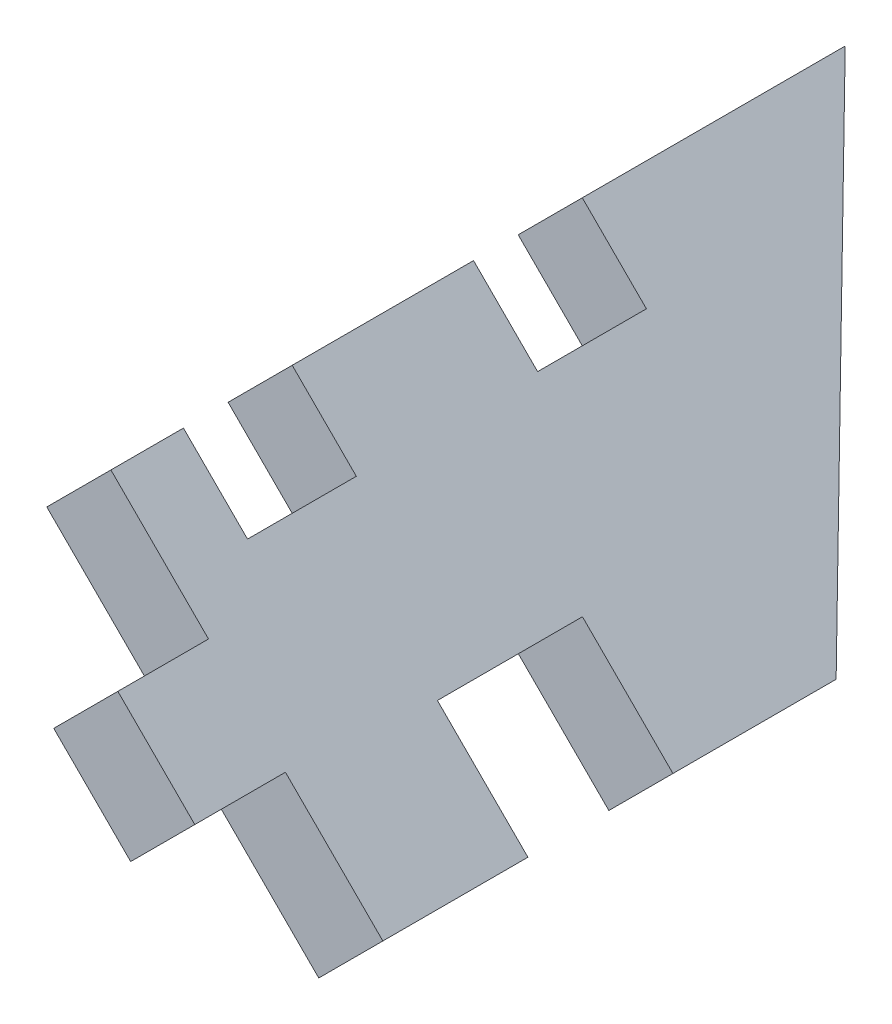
ISO-10303-21;
HEADER;
FILE_DESCRIPTION(('STEP AP214'),'2;1');
FILE_NAME('part.step','',(''),(''),'','','');
FILE_SCHEMA(('AUTOMOTIVE_DESIGN { 1 0 10303 214 1 1 1 1 }'));
ENDSEC;
DATA;
#1=APPLICATION_CONTEXT('core data for automotive mechanical design processes');
#2=APPLICATION_PROTOCOL_DEFINITION('international standard','automotive_design',2000,#1);
#3=PRODUCT_CONTEXT('',#1,'mechanical');
#4=PRODUCT('Part','Part','',(#3));
#5=PRODUCT_RELATED_PRODUCT_CATEGORY('part','',(#4));
#6=PRODUCT_DEFINITION_FORMATION('','',#4);
#7=PRODUCT_DEFINITION_CONTEXT('part definition',#1,'design');
#8=PRODUCT_DEFINITION('design','',#6,#7);
#9=PRODUCT_DEFINITION_SHAPE('','',#8);
#10=(LENGTH_UNIT() NAMED_UNIT(*) SI_UNIT(.MILLI.,.METRE.));
#11=(NAMED_UNIT(*) PLANE_ANGLE_UNIT() SI_UNIT($,.RADIAN.));
#12=(NAMED_UNIT(*) SI_UNIT($,.STERADIAN.) SOLID_ANGLE_UNIT());
#13=UNCERTAINTY_MEASURE_WITH_UNIT(LENGTH_MEASURE(1.E-05),#10,'distance_accuracy_value','');
#14=(GEOMETRIC_REPRESENTATION_CONTEXT(3) GLOBAL_UNCERTAINTY_ASSIGNED_CONTEXT((#13)) GLOBAL_UNIT_ASSIGNED_CONTEXT((#10,
#11,#12)) REPRESENTATION_CONTEXT('',''));
#15=CARTESIAN_POINT('',(0.,0.,0.));
#16=DIRECTION('',(0.,0.,1.));
#17=DIRECTION('',(1.,0.,0.));
#18=AXIS2_PLACEMENT_3D('',#15,#16,#17);
#19=CARTESIAN_POINT('',(-14.5598719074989,23.5401280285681,0.));
#20=DIRECTION('',(-0.707106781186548,0.707106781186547,0.));
#21=DIRECTION('',(-0.707106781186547,-0.707106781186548,0.));
#22=AXIS2_PLACEMENT_3D('',#19,#20,#21);
#23=PLANE('',#22);
#24=DIRECTION('',(0.707106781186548,0.707106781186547,0.));
#25=VECTOR('',#24,1.);
#26=CARTESIAN_POINT('',(-86.4019208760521,-48.3019209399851,-25.4));
#27=LINE('',#26,#25);
#28=CARTESIAN_POINT('',(-19.0499999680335,19.0499999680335,-25.4));
#29=VERTEX_POINT('',#28);
#30=CARTESIAN_POINT('',(-14.5598719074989,23.5401280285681,-25.4));
#31=VERTEX_POINT('',#30);
#32=EDGE_CURVE('E185',#29,#31,#27,.T.);
#33=ORIENTED_EDGE('',*,*,#32,.F.);
#34=DIRECTION('',(0.,0.,-1.));
#35=VECTOR('',#34,1.);
#36=CARTESIAN_POINT('',(-19.0499999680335,19.0499999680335,0.));
#37=LINE('',#36,#35);
#38=CARTESIAN_POINT('',(-19.0499999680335,19.0499999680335,-12.7));
#39=VERTEX_POINT('',#38);
#40=EDGE_CURVE('E257',#39,#29,#37,.T.);
#41=ORIENTED_EDGE('',*,*,#40,.F.);
#42=DIRECTION('',(0.707106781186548,0.707106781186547,0.));
#43=VECTOR('',#42,1.);
#44=CARTESIAN_POINT('',(-86.4019208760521,-48.3019209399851,-12.7));
#45=LINE('',#44,#43);
#46=CARTESIAN_POINT('',(-14.5598719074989,23.5401280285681,-12.7));
#47=VERTEX_POINT('',#46);
#48=EDGE_CURVE('E213',#39,#47,#45,.T.);
#49=ORIENTED_EDGE('',*,*,#48,.T.);
#50=DIRECTION('',(0.,0.,-1.));
#51=VECTOR('',#50,1.);
#52=CARTESIAN_POINT('',(-14.5598719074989,23.5401280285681,0.));
#53=LINE('',#52,#51);
#54=EDGE_CURVE('E206',#47,#31,#53,.T.);
#55=ORIENTED_EDGE('',*,*,#54,.T.);
#56=EDGE_LOOP('',(#33,#41,#49,#55));
#57=FACE_BOUND('',#56,.T.);
#58=ADVANCED_FACE('F47',(#57),#23,.T.);
#59=DIRECTION('',(0.707106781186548,0.707106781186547,0.));
#60=VECTOR('',#59,1.);
#61=CARTESIAN_POINT('',(-86.4019208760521,-48.3019209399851,-5.07999999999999));
#62=LINE('',#61,#60);
#63=CARTESIAN_POINT('',(-19.0499999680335,19.0499999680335,-5.08));
#64=VERTEX_POINT('',#63);
#65=CARTESIAN_POINT('',(-14.5598719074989,23.5401280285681,-5.08));
#66=VERTEX_POINT('',#65);
#67=EDGE_CURVE('E251',#64,#66,#62,.T.);
#68=ORIENTED_EDGE('',*,*,#67,.F.);
#69=CARTESIAN_POINT('',(-19.0499999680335,19.0499999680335,0.));
#70=VERTEX_POINT('',#69);
#71=EDGE_CURVE('E252',#70,#64,#37,.T.);
#72=ORIENTED_EDGE('',*,*,#71,.F.);
#73=DIRECTION('',(-0.707106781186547,-0.707106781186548,0.));
#74=VECTOR('',#73,1.);
#75=CARTESIAN_POINT('',(-14.5598719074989,23.5401280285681,0.));
#76=LINE('',#75,#74);
#77=CARTESIAN_POINT('',(-14.5598719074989,23.5401280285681,0.));
#78=VERTEX_POINT('',#77);
#79=EDGE_CURVE('E297',#78,#70,#76,.T.);
#80=ORIENTED_EDGE('',*,*,#79,.F.);
#81=EDGE_CURVE('E215',#78,#66,#53,.T.);
#82=ORIENTED_EDGE('',*,*,#81,.T.);
#83=EDGE_LOOP('',(#68,#72,#80,#82));
#84=FACE_BOUND('',#83,.T.);
#85=ADVANCED_FACE('F390',(#84),#23,.T.);
#86=CARTESIAN_POINT('',(4.49012806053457,4.49012806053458,0.));
#87=DIRECTION('',(-0.707106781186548,0.707106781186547,0.));
#88=DIRECTION('',(-0.707106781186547,-0.707106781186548,0.));
#89=AXIS2_PLACEMENT_3D('',#86,#87,#88);
#90=PLANE('',#89);
#91=DIRECTION('',(0.,0.,-1.));
#92=VECTOR('',#91,1.);
#93=CARTESIAN_POINT('',(0.,0.,0.));
#94=LINE('',#93,#92);
#95=CARTESIAN_POINT('',(0.,0.,0.));
#96=VERTEX_POINT('',#95);
#97=CARTESIAN_POINT('',(0.,0.,-10.16));
#98=VERTEX_POINT('',#97);
#99=EDGE_CURVE('E273',#96,#98,#94,.T.);
#100=ORIENTED_EDGE('',*,*,#99,.T.);
#101=DIRECTION('',(0.707106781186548,0.707106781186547,0.));
#102=VECTOR('',#101,1.);
#103=CARTESIAN_POINT('',(-67.3519209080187,-67.3519209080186,-10.16));
#104=LINE('',#103,#102);
#105=CARTESIAN_POINT('',(4.49012806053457,4.49012806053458,-10.16));
#106=VERTEX_POINT('',#105);
#107=EDGE_CURVE('E353',#98,#106,#104,.T.);
#108=ORIENTED_EDGE('',*,*,#107,.T.);
#109=DIRECTION('',(0.,0.,-1.));
#110=VECTOR('',#109,1.);
#111=CARTESIAN_POINT('',(4.49012806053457,4.49012806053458,0.));
#112=LINE('',#111,#110);
#113=CARTESIAN_POINT('',(4.49012806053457,4.49012806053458,0.));
#114=VERTEX_POINT('',#113);
#115=EDGE_CURVE('E240',#114,#106,#112,.T.);
#116=ORIENTED_EDGE('',*,*,#115,.F.);
#117=DIRECTION('',(-0.707106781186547,-0.707106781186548,0.));
#118=VECTOR('',#117,1.);
#119=CARTESIAN_POINT('',(4.49012806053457,4.49012806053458,0.));
#120=LINE('',#119,#118);
#121=EDGE_CURVE('E281',#114,#96,#120,.T.);
#122=ORIENTED_EDGE('',*,*,#121,.T.);
#123=EDGE_LOOP('',(#100,#108,#116,#122));
#124=FACE_BOUND('',#123,.T.);
#125=ADVANCED_FACE('F456',(#124),#90,.F.);
#126=CARTESIAN_POINT('',(15.1846228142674,-6.20436669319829,-20.6990220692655));
#127=DIRECTION('',(0.417170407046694,-0.417170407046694,-0.807426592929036));
#128=DIRECTION('',(-0.888425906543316,0.,-0.459020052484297));
#129=AXIS2_PLACEMENT_3D('',#126,#127,#128);
#130=PLANE('',#129);
#131=DIRECTION('',(0.570936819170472,-0.570936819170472,0.589968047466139));
#132=VECTOR('',#131,1.);
#133=CARTESIAN_POINT('',(10.6944947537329,-10.6944947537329,-20.6990220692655));
#134=LINE('',#133,#132);
#135=CARTESIAN_POINT('',(-19.0499999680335,19.0499999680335,-51.435));
#136=VERTEX_POINT('',#135);
#137=CARTESIAN_POINT('',(0.,0.,-31.75));
#138=VERTEX_POINT('',#137);
#139=EDGE_CURVE('E246',#136,#138,#134,.T.);
#140=ORIENTED_EDGE('',*,*,#139,.F.);
#141=DIRECTION('',(-0.707106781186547,-0.707106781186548,0.));
#142=VECTOR('',#141,1.);
#143=CARTESIAN_POINT('',(-14.5598719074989,23.5401280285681,-51.435));
#144=LINE('',#143,#142);
#145=CARTESIAN_POINT('',(-14.5598719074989,23.5401280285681,-51.435));
#146=VERTEX_POINT('',#145);
#147=EDGE_CURVE('E300',#146,#136,#144,.T.);
#148=ORIENTED_EDGE('',*,*,#147,.F.);
#149=DIRECTION('',(0.570936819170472,-0.570936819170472,0.589968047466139));
#150=VECTOR('',#149,1.);
#151=CARTESIAN_POINT('',(15.1846228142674,-6.20436669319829,-20.6990220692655));
#152=LINE('',#151,#150);
#153=CARTESIAN_POINT('',(4.49012806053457,4.49012806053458,-31.75));
#154=VERTEX_POINT('',#153);
#155=EDGE_CURVE('E222',#146,#154,#152,.T.);
#156=ORIENTED_EDGE('',*,*,#155,.T.);
#157=DIRECTION('',(-0.707106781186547,-0.707106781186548,0.));
#158=VECTOR('',#157,1.);
#159=CARTESIAN_POINT('',(4.49012806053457,4.49012806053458,-31.75));
#160=LINE('',#159,#158);
#161=EDGE_CURVE('E244',#154,#138,#160,.T.);
#162=ORIENTED_EDGE('',*,*,#161,.T.);
#163=EDGE_LOOP('',(#140,#148,#156,#162));
#164=FACE_BOUND('',#163,.T.);
#165=ADVANCED_FACE('F49',(#164),#130,.T.);
#166=DIRECTION('',(0.707106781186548,0.707106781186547,0.));
#167=VECTOR('',#166,1.);
#168=CARTESIAN_POINT('',(-86.4019208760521,-48.3019209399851,-33.02));
#169=LINE('',#168,#167);
#170=CARTESIAN_POINT('',(-19.0499999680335,19.0499999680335,-33.02));
#171=VERTEX_POINT('',#170);
#172=CARTESIAN_POINT('',(-14.5598719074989,23.5401280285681,-33.02));
#173=VERTEX_POINT('',#172);
#174=EDGE_CURVE('E198',#171,#173,#169,.T.);
#175=ORIENTED_EDGE('',*,*,#174,.T.);
#176=EDGE_CURVE('E216',#173,#146,#53,.T.);
#177=ORIENTED_EDGE('',*,*,#176,.T.);
#178=ORIENTED_EDGE('',*,*,#147,.T.);
#179=EDGE_CURVE('E250',#171,#136,#37,.T.);
#180=ORIENTED_EDGE('',*,*,#179,.F.);
#181=EDGE_LOOP('',(#175,#177,#178,#180));
#182=FACE_BOUND('',#181,.T.);
#183=ADVANCED_FACE('F438',(#182),#23,.T.);
#184=CARTESIAN_POINT('',(4.49012806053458,4.49012806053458,0.));
#185=DIRECTION('',(0.,0.,1.));
#186=DIRECTION('',(1.,0.,0.));
#187=AXIS2_PLACEMENT_3D('',#184,#185,#186);
#188=PLANE('',#187);
#189=DIRECTION('',(-0.707106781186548,0.707106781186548,0.));
#190=VECTOR('',#189,1.);
#191=CARTESIAN_POINT('',(0.,0.,0.));
#192=LINE('',#191,#190);
#193=CARTESIAN_POINT('',(-12.2131483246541,12.2131483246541,0.));
#194=VERTEX_POINT('',#193);
#195=EDGE_CURVE('E256',#194,#70,#192,.T.);
#196=ORIENTED_EDGE('',*,*,#195,.F.);
#197=DIRECTION('',(-0.707106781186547,-0.707106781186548,0.));
#198=VECTOR('',#197,1.);
#199=CARTESIAN_POINT('',(-7.72302026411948,16.7032763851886,0.));
#200=LINE('',#199,#198);
#201=CARTESIAN_POINT('',(-7.72302026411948,16.7032763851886,0.));
#202=VERTEX_POINT('',#201);
#203=EDGE_CURVE('E294',#202,#194,#200,.T.);
#204=ORIENTED_EDGE('',*,*,#203,.F.);
#205=DIRECTION('',(-0.707106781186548,0.707106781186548,0.));
#206=VECTOR('',#205,1.);
#207=CARTESIAN_POINT('',(4.49012806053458,4.49012806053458,0.));
#208=LINE('',#207,#206);
#209=EDGE_CURVE('E221',#202,#78,#208,.T.);
#210=ORIENTED_EDGE('',*,*,#209,.T.);
#211=ORIENTED_EDGE('',*,*,#79,.T.);
#212=EDGE_LOOP('',(#196,#204,#210,#211));
#213=FACE_BOUND('',#212,.T.);
#214=ADVANCED_FACE('F394',(#213),#188,.T.);
#215=CARTESIAN_POINT('',(-7.72302026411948,16.7032763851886,0.));
#216=DIRECTION('',(0.707106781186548,-0.707106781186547,0.));
#217=DIRECTION('',(0.707106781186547,0.707106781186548,0.));
#218=AXIS2_PLACEMENT_3D('',#215,#216,#217);
#219=PLANE('',#218);
#220=DIRECTION('',(0.,0.,1.));
#221=VECTOR('',#220,1.);
#222=CARTESIAN_POINT('',(-12.2131483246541,12.2131483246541,0.));
#223=LINE('',#222,#221);
#224=CARTESIAN_POINT('',(-12.2131483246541,12.2131483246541,6.35));
#225=VERTEX_POINT('',#224);
#226=EDGE_CURVE('E261',#194,#225,#223,.T.);
#227=ORIENTED_EDGE('',*,*,#226,.T.);
#228=DIRECTION('',(-0.707106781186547,-0.707106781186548,0.));
#229=VECTOR('',#228,1.);
#230=CARTESIAN_POINT('',(-7.72302026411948,16.7032763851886,6.35));
#231=LINE('',#230,#229);
#232=CARTESIAN_POINT('',(-7.72302026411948,16.7032763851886,6.35));
#233=VERTEX_POINT('',#232);
#234=EDGE_CURVE('E290',#233,#225,#231,.T.);
#235=ORIENTED_EDGE('',*,*,#234,.F.);
#236=DIRECTION('',(0.,0.,1.));
#237=VECTOR('',#236,1.);
#238=CARTESIAN_POINT('',(-7.72302026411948,16.7032763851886,0.));
#239=LINE('',#238,#237);
#240=EDGE_CURVE('E229',#202,#233,#239,.T.);
#241=ORIENTED_EDGE('',*,*,#240,.F.);
#242=ORIENTED_EDGE('',*,*,#203,.T.);
#243=EDGE_LOOP('',(#227,#235,#241,#242));
#244=FACE_BOUND('',#243,.T.);
#245=ADVANCED_FACE('F399',(#244),#219,.F.);
#246=CARTESIAN_POINT('',(4.49012806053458,4.49012806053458,6.35));
#247=DIRECTION('',(0.,0.,-1.));
#248=DIRECTION('',(-1.,0.,0.));
#249=AXIS2_PLACEMENT_3D('',#246,#247,#248);
#250=PLANE('',#249);
#251=DIRECTION('',(0.707106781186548,-0.707106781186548,0.));
#252=VECTOR('',#251,1.);
#253=CARTESIAN_POINT('',(0.,0.,6.35));
#254=LINE('',#253,#252);
#255=CARTESIAN_POINT('',(-6.82499465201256,6.82499465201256,6.35));
#256=VERTEX_POINT('',#255);
#257=EDGE_CURVE('E265',#225,#256,#254,.T.);
#258=ORIENTED_EDGE('',*,*,#257,.T.);
#259=DIRECTION('',(-0.707106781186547,-0.707106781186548,0.));
#260=VECTOR('',#259,1.);
#261=CARTESIAN_POINT('',(-2.33486659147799,11.3151227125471,6.35));
#262=LINE('',#261,#260);
#263=CARTESIAN_POINT('',(-2.33486659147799,11.3151227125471,6.35));
#264=VERTEX_POINT('',#263);
#265=EDGE_CURVE('E287',#264,#256,#262,.T.);
#266=ORIENTED_EDGE('',*,*,#265,.F.);
#267=DIRECTION('',(0.707106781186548,-0.707106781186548,0.));
#268=VECTOR('',#267,1.);
#269=CARTESIAN_POINT('',(4.49012806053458,4.49012806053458,6.35));
#270=LINE('',#269,#268);
#271=EDGE_CURVE('E233',#233,#264,#270,.T.);
#272=ORIENTED_EDGE('',*,*,#271,.F.);
#273=ORIENTED_EDGE('',*,*,#234,.T.);
#274=EDGE_LOOP('',(#258,#266,#272,#273));
#275=FACE_BOUND('',#274,.T.);
#276=ADVANCED_FACE('F406',(#275),#250,.F.);
#277=CARTESIAN_POINT('',(-2.33486659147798,11.3151227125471,0.));
#278=DIRECTION('',(0.707106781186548,-0.707106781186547,0.));
#279=DIRECTION('',(0.707106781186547,0.707106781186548,0.));
#280=AXIS2_PLACEMENT_3D('',#277,#278,#279);
#281=PLANE('',#280);
#282=DIRECTION('',(0.,0.,1.));
#283=VECTOR('',#282,1.);
#284=CARTESIAN_POINT('',(-6.82499465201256,6.82499465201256,0.));
#285=LINE('',#284,#283);
#286=CARTESIAN_POINT('',(-6.82499465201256,6.82499465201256,0.));
#287=VERTEX_POINT('',#286);
#288=EDGE_CURVE('E269',#287,#256,#285,.T.);
#289=ORIENTED_EDGE('',*,*,#288,.F.);
#290=DIRECTION('',(-0.707106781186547,-0.707106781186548,0.));
#291=VECTOR('',#290,1.);
#292=CARTESIAN_POINT('',(-2.33486659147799,11.3151227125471,0.));
#293=LINE('',#292,#291);
#294=CARTESIAN_POINT('',(-2.33486659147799,11.3151227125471,0.));
#295=VERTEX_POINT('',#294);
#296=EDGE_CURVE('E284',#295,#287,#293,.T.);
#297=ORIENTED_EDGE('',*,*,#296,.F.);
#298=DIRECTION('',(0.,0.,1.));
#299=VECTOR('',#298,1.);
#300=CARTESIAN_POINT('',(-2.33486659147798,11.3151227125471,0.));
#301=LINE('',#300,#299);
#302=EDGE_CURVE('E236',#295,#264,#301,.T.);
#303=ORIENTED_EDGE('',*,*,#302,.T.);
#304=ORIENTED_EDGE('',*,*,#265,.T.);
#305=EDGE_LOOP('',(#289,#297,#303,#304));
#306=FACE_BOUND('',#305,.T.);
#307=ADVANCED_FACE('F410',(#306),#281,.T.);
#308=EDGE_CURVE('E262',#96,#287,#192,.T.);
#309=ORIENTED_EDGE('',*,*,#308,.F.);
#310=ORIENTED_EDGE('',*,*,#121,.F.);
#311=EDGE_CURVE('E230',#114,#295,#208,.T.);
#312=ORIENTED_EDGE('',*,*,#311,.T.);
#313=ORIENTED_EDGE('',*,*,#296,.T.);
#314=EDGE_LOOP('',(#309,#310,#312,#313));
#315=FACE_BOUND('',#314,.T.);
#316=ADVANCED_FACE('F414',(#315),#188,.T.);
#317=CARTESIAN_POINT('',(4.49012806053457,4.49012806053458,-20.32));
#318=VERTEX_POINT('',#317);
#319=EDGE_CURVE('E245',#318,#154,#112,.T.);
#320=ORIENTED_EDGE('',*,*,#319,.F.);
#321=DIRECTION('',(0.707106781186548,0.707106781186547,0.));
#322=VECTOR('',#321,1.);
#323=CARTESIAN_POINT('',(-67.3519209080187,-67.3519209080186,-20.32));
#324=LINE('',#323,#322);
#325=CARTESIAN_POINT('',(0.,0.,-20.32));
#326=VERTEX_POINT('',#325);
#327=EDGE_CURVE('E346',#326,#318,#324,.T.);
#328=ORIENTED_EDGE('',*,*,#327,.F.);
#329=EDGE_CURVE('E277',#326,#138,#94,.T.);
#330=ORIENTED_EDGE('',*,*,#329,.T.);
#331=ORIENTED_EDGE('',*,*,#161,.F.);
#332=EDGE_LOOP('',(#320,#328,#330,#331));
#333=FACE_BOUND('',#332,.T.);
#334=ADVANCED_FACE('F426',(#333),#90,.F.);
#335=CARTESIAN_POINT('',(4.49012806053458,4.49012806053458,0.));
#336=DIRECTION('',(0.707106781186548,0.707106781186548,0.));
#337=DIRECTION('',(-0.707106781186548,0.707106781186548,0.));
#338=AXIS2_PLACEMENT_3D('',#335,#336,#337);
#339=PLANE('',#338);
#340=DIRECTION('',(0.707106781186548,-0.707106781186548,0.));
#341=VECTOR('',#340,1.);
#342=CARTESIAN_POINT('',(4.49012806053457,4.49012806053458,-10.16));
#343=LINE('',#342,#341);
#344=CARTESIAN_POINT('',(-1.84993276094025,10.8301888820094,-10.16));
#345=VERTEX_POINT('',#344);
#346=EDGE_CURVE('E199',#345,#106,#343,.T.);
#347=ORIENTED_EDGE('',*,*,#346,.F.);
#348=DIRECTION('',(0.,0.,1.));
#349=VECTOR('',#348,1.);
#350=CARTESIAN_POINT('',(-1.84993276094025,10.8301888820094,-10.16));
#351=LINE('',#350,#349);
#352=CARTESIAN_POINT('',(-1.84993276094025,10.8301888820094,-20.32));
#353=VERTEX_POINT('',#352);
#354=EDGE_CURVE('E341',#353,#345,#351,.T.);
#355=ORIENTED_EDGE('',*,*,#354,.F.);
#356=DIRECTION('',(-0.707106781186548,0.707106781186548,0.));
#357=VECTOR('',#356,1.);
#358=CARTESIAN_POINT('',(4.49012806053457,4.49012806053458,-20.32));
#359=LINE('',#358,#357);
#360=EDGE_CURVE('E352',#318,#353,#359,.T.);
#361=ORIENTED_EDGE('',*,*,#360,.F.);
#362=ORIENTED_EDGE('',*,*,#319,.T.);
#363=ORIENTED_EDGE('',*,*,#155,.F.);
#364=ORIENTED_EDGE('',*,*,#176,.F.);
#365=DIRECTION('',(-0.707106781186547,0.707106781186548,0.));
#366=VECTOR('',#365,1.);
#367=CARTESIAN_POINT('',(-14.5598719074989,23.5401280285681,-33.02));
#368=LINE('',#367,#366);
#369=CARTESIAN_POINT('',(-10.0697438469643,19.0499999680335,-33.02));
#370=VERTEX_POINT('',#369);
#371=EDGE_CURVE('E439',#370,#173,#368,.T.);
#372=ORIENTED_EDGE('',*,*,#371,.F.);
#373=DIRECTION('',(0.,0.,-1.));
#374=VECTOR('',#373,1.);
#375=CARTESIAN_POINT('',(-10.0697438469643,19.0499999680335,-25.4));
#376=LINE('',#375,#374);
#377=CARTESIAN_POINT('',(-10.0697438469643,19.0499999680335,-25.4));
#378=VERTEX_POINT('',#377);
#379=EDGE_CURVE('E208',#378,#370,#376,.T.);
#380=ORIENTED_EDGE('',*,*,#379,.F.);
#381=DIRECTION('',(0.707106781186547,-0.707106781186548,0.));
#382=VECTOR('',#381,1.);
#383=CARTESIAN_POINT('',(-14.5598719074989,23.5401280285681,-25.4));
#384=LINE('',#383,#382);
#385=EDGE_CURVE('E189',#31,#378,#384,.T.);
#386=ORIENTED_EDGE('',*,*,#385,.F.);
#387=ORIENTED_EDGE('',*,*,#54,.F.);
#388=DIRECTION('',(-0.707106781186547,0.707106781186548,0.));
#389=VECTOR('',#388,1.);
#390=CARTESIAN_POINT('',(-14.5598719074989,23.5401280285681,-12.7));
#391=LINE('',#390,#389);
#392=CARTESIAN_POINT('',(-10.0697438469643,19.0499999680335,-12.7));
#393=VERTEX_POINT('',#392);
#394=EDGE_CURVE('E365',#393,#47,#391,.T.);
#395=ORIENTED_EDGE('',*,*,#394,.F.);
#396=DIRECTION('',(0.,0.,-1.));
#397=VECTOR('',#396,1.);
#398=CARTESIAN_POINT('',(-10.0697438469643,19.0499999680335,-5.08));
#399=LINE('',#398,#397);
#400=CARTESIAN_POINT('',(-10.0697438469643,19.0499999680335,-5.08));
#401=VERTEX_POINT('',#400);
#402=EDGE_CURVE('E361',#401,#393,#399,.T.);
#403=ORIENTED_EDGE('',*,*,#402,.F.);
#404=DIRECTION('',(0.707106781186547,-0.707106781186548,0.));
#405=VECTOR('',#404,1.);
#406=CARTESIAN_POINT('',(-14.5598719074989,23.5401280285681,-5.08));
#407=LINE('',#406,#405);
#408=EDGE_CURVE('E210',#66,#401,#407,.T.);
#409=ORIENTED_EDGE('',*,*,#408,.F.);
#410=ORIENTED_EDGE('',*,*,#81,.F.);
#411=ORIENTED_EDGE('',*,*,#209,.F.);
#412=ORIENTED_EDGE('',*,*,#240,.T.);
#413=ORIENTED_EDGE('',*,*,#271,.T.);
#414=ORIENTED_EDGE('',*,*,#302,.F.);
#415=ORIENTED_EDGE('',*,*,#311,.F.);
#416=ORIENTED_EDGE('',*,*,#115,.T.);
#417=EDGE_LOOP('',(#347,#355,#361,#362,#363,#364,#372,#380,#386,#387,#395,#403,#409,#410,#411,
#412,#413,#414,#415,#416));
#418=FACE_BOUND('',#417,.T.);
#419=ADVANCED_FACE('F204',(#418),#339,.T.);
#420=CARTESIAN_POINT('',(0.,0.,0.));
#421=DIRECTION('',(0.707106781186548,0.707106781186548,0.));
#422=DIRECTION('',(-0.707106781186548,0.707106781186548,0.));
#423=AXIS2_PLACEMENT_3D('',#420,#421,#422);
#424=PLANE('',#423);
#425=DIRECTION('',(0.,0.,1.));
#426=VECTOR('',#425,1.);
#427=CARTESIAN_POINT('',(-6.34006082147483,6.34006082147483,0.));
#428=LINE('',#427,#426);
#429=CARTESIAN_POINT('',(-6.34006082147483,6.34006082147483,-20.32));
#430=VERTEX_POINT('',#429);
#431=CARTESIAN_POINT('',(-6.34006082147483,6.34006082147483,-10.16));
#432=VERTEX_POINT('',#431);
#433=EDGE_CURVE('E56',#430,#432,#428,.T.);
#434=ORIENTED_EDGE('',*,*,#433,.T.);
#435=DIRECTION('',(0.707106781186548,-0.707106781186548,0.));
#436=VECTOR('',#435,1.);
#437=CARTESIAN_POINT('',(0.,0.,-10.16));
#438=LINE('',#437,#436);
#439=EDGE_CURVE('E11',#432,#98,#438,.T.);
#440=ORIENTED_EDGE('',*,*,#439,.T.);
#441=ORIENTED_EDGE('',*,*,#99,.F.);
#442=ORIENTED_EDGE('',*,*,#308,.T.);
#443=ORIENTED_EDGE('',*,*,#288,.T.);
#444=ORIENTED_EDGE('',*,*,#257,.F.);
#445=ORIENTED_EDGE('',*,*,#226,.F.);
#446=ORIENTED_EDGE('',*,*,#195,.T.);
#447=ORIENTED_EDGE('',*,*,#71,.T.);
#448=DIRECTION('',(0.707106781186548,-0.707106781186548,0.));
#449=VECTOR('',#448,1.);
#450=CARTESIAN_POINT('',(0.,0.,-5.08));
#451=LINE('',#450,#449);
#452=CARTESIAN_POINT('',(-14.5598719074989,14.5598719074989,-5.08));
#453=VERTEX_POINT('',#452);
#454=EDGE_CURVE('E312',#64,#453,#451,.T.);
#455=ORIENTED_EDGE('',*,*,#454,.T.);
#456=DIRECTION('',(0.,0.,-1.));
#457=VECTOR('',#456,1.);
#458=CARTESIAN_POINT('',(-14.5598719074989,14.5598719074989,0.));
#459=LINE('',#458,#457);
#460=CARTESIAN_POINT('',(-14.5598719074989,14.5598719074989,-12.7));
#461=VERTEX_POINT('',#460);
#462=EDGE_CURVE('E304',#453,#461,#459,.T.);
#463=ORIENTED_EDGE('',*,*,#462,.T.);
#464=DIRECTION('',(-0.707106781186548,0.707106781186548,0.));
#465=VECTOR('',#464,1.);
#466=CARTESIAN_POINT('',(0.,0.,-12.7));
#467=LINE('',#466,#465);
#468=EDGE_CURVE('E308',#461,#39,#467,.T.);
#469=ORIENTED_EDGE('',*,*,#468,.T.);
#470=ORIENTED_EDGE('',*,*,#40,.T.);
#471=DIRECTION('',(0.707106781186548,-0.707106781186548,0.));
#472=VECTOR('',#471,1.);
#473=CARTESIAN_POINT('',(0.,0.,-25.4));
#474=LINE('',#473,#472);
#475=CARTESIAN_POINT('',(-14.5598719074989,14.5598719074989,-25.4));
#476=VERTEX_POINT('',#475);
#477=EDGE_CURVE('E192',#29,#476,#474,.T.);
#478=ORIENTED_EDGE('',*,*,#477,.T.);
#479=DIRECTION('',(0.,0.,-1.));
#480=VECTOR('',#479,1.);
#481=CARTESIAN_POINT('',(-14.5598719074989,14.5598719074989,0.));
#482=LINE('',#481,#480);
#483=CARTESIAN_POINT('',(-14.5598719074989,14.5598719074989,-33.02));
#484=VERTEX_POINT('',#483);
#485=EDGE_CURVE('E316',#476,#484,#482,.T.);
#486=ORIENTED_EDGE('',*,*,#485,.T.);
#487=DIRECTION('',(-0.707106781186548,0.707106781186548,0.));
#488=VECTOR('',#487,1.);
#489=CARTESIAN_POINT('',(0.,0.,-33.02));
#490=LINE('',#489,#488);
#491=EDGE_CURVE('E320',#484,#171,#490,.T.);
#492=ORIENTED_EDGE('',*,*,#491,.T.);
#493=ORIENTED_EDGE('',*,*,#179,.T.);
#494=ORIENTED_EDGE('',*,*,#139,.T.);
#495=ORIENTED_EDGE('',*,*,#329,.F.);
#496=DIRECTION('',(-0.707106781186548,0.707106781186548,0.));
#497=VECTOR('',#496,1.);
#498=CARTESIAN_POINT('',(0.,0.,-20.32));
#499=LINE('',#498,#497);
#500=EDGE_CURVE('E326',#326,#430,#499,.T.);
#501=ORIENTED_EDGE('',*,*,#500,.T.);
#502=EDGE_LOOP('',(#434,#440,#441,#442,#443,#444,#445,#446,#447,#455,#463,#469,#470,#478,#486,
#492,#493,#494,#495,#501));
#503=FACE_BOUND('',#502,.T.);
#504=ADVANCED_FACE('F332',(#503),#424,.F.);
#505=CARTESIAN_POINT('',(-86.4019208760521,-48.3019209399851,-5.07999999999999));
#506=DIRECTION('',(0.,0.,1.));
#507=DIRECTION('',(1.,0.,0.));
#508=AXIS2_PLACEMENT_3D('',#505,#506,#507);
#509=PLANE('',#508);
#510=ORIENTED_EDGE('',*,*,#67,.T.);
#511=ORIENTED_EDGE('',*,*,#408,.T.);
#512=DIRECTION('',(0.707106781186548,0.707106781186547,0.));
#513=VECTOR('',#512,1.);
#514=CARTESIAN_POINT('',(-81.9117928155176,-52.7920490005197,-5.08));
#515=LINE('',#514,#513);
#516=EDGE_CURVE('E368',#453,#401,#515,.T.);
#517=ORIENTED_EDGE('',*,*,#516,.F.);
#518=ORIENTED_EDGE('',*,*,#454,.F.);
#519=EDGE_LOOP('',(#510,#511,#517,#518));
#520=FACE_BOUND('',#519,.T.);
#521=ADVANCED_FACE('F382',(#520),#509,.F.);
#522=CARTESIAN_POINT('',(-86.4019208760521,-48.3019209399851,-12.7));
#523=DIRECTION('',(0.,0.,-1.));
#524=DIRECTION('',(-1.,0.,0.));
#525=AXIS2_PLACEMENT_3D('',#522,#523,#524);
#526=PLANE('',#525);
#527=DIRECTION('',(0.707106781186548,0.707106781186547,0.));
#528=VECTOR('',#527,1.);
#529=CARTESIAN_POINT('',(-81.9117928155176,-52.7920490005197,-12.7));
#530=LINE('',#529,#528);
#531=EDGE_CURVE('E373',#461,#393,#530,.T.);
#532=ORIENTED_EDGE('',*,*,#531,.T.);
#533=ORIENTED_EDGE('',*,*,#394,.T.);
#534=ORIENTED_EDGE('',*,*,#48,.F.);
#535=ORIENTED_EDGE('',*,*,#468,.F.);
#536=EDGE_LOOP('',(#532,#533,#534,#535));
#537=FACE_BOUND('',#536,.T.);
#538=ADVANCED_FACE('F386',(#537),#526,.F.);
#539=CARTESIAN_POINT('',(-81.9117928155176,-52.7920490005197,-5.08));
#540=DIRECTION('',(0.707106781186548,-0.707106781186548,0.));
#541=DIRECTION('',(0.707106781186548,0.707106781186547,0.));
#542=AXIS2_PLACEMENT_3D('',#539,#540,#541);
#543=PLANE('',#542);
#544=ORIENTED_EDGE('',*,*,#516,.T.);
#545=ORIENTED_EDGE('',*,*,#402,.T.);
#546=ORIENTED_EDGE('',*,*,#531,.F.);
#547=ORIENTED_EDGE('',*,*,#462,.F.);
#548=EDGE_LOOP('',(#544,#545,#546,#547));
#549=FACE_BOUND('',#548,.T.);
#550=ADVANCED_FACE('F378',(#549),#543,.F.);
#551=CARTESIAN_POINT('',(-86.4019208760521,-48.3019209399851,-25.4));
#552=DIRECTION('',(0.,0.,1.));
#553=DIRECTION('',(1.,0.,0.));
#554=AXIS2_PLACEMENT_3D('',#551,#552,#553);
#555=PLANE('',#554);
#556=ORIENTED_EDGE('',*,*,#32,.T.);
#557=ORIENTED_EDGE('',*,*,#385,.T.);
#558=DIRECTION('',(0.707106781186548,0.707106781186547,0.));
#559=VECTOR('',#558,1.);
#560=CARTESIAN_POINT('',(-81.9117928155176,-52.7920490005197,-25.4));
#561=LINE('',#560,#559);
#562=EDGE_CURVE('E442',#476,#378,#561,.T.);
#563=ORIENTED_EDGE('',*,*,#562,.F.);
#564=ORIENTED_EDGE('',*,*,#477,.F.);
#565=EDGE_LOOP('',(#556,#557,#563,#564));
#566=FACE_BOUND('',#565,.T.);
#567=ADVANCED_FACE('F187',(#566),#555,.F.);
#568=CARTESIAN_POINT('',(-86.4019208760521,-48.3019209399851,-33.02));
#569=DIRECTION('',(0.,0.,-1.));
#570=DIRECTION('',(-1.,0.,0.));
#571=AXIS2_PLACEMENT_3D('',#568,#569,#570);
#572=PLANE('',#571);
#573=DIRECTION('',(0.707106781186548,0.707106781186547,0.));
#574=VECTOR('',#573,1.);
#575=CARTESIAN_POINT('',(-81.9117928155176,-52.7920490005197,-33.02));
#576=LINE('',#575,#574);
#577=EDGE_CURVE('E71',#484,#370,#576,.T.);
#578=ORIENTED_EDGE('',*,*,#577,.T.);
#579=ORIENTED_EDGE('',*,*,#371,.T.);
#580=ORIENTED_EDGE('',*,*,#174,.F.);
#581=ORIENTED_EDGE('',*,*,#491,.F.);
#582=EDGE_LOOP('',(#578,#579,#580,#581));
#583=FACE_BOUND('',#582,.T.);
#584=ADVANCED_FACE('F584',(#583),#572,.F.);
#585=CARTESIAN_POINT('',(-81.9117928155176,-52.7920490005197,-25.4));
#586=DIRECTION('',(0.707106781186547,-0.707106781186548,0.));
#587=DIRECTION('',(0.707106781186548,0.707106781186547,0.));
#588=AXIS2_PLACEMENT_3D('',#585,#586,#587);
#589=PLANE('',#588);
#590=ORIENTED_EDGE('',*,*,#562,.T.);
#591=ORIENTED_EDGE('',*,*,#379,.T.);
#592=ORIENTED_EDGE('',*,*,#577,.F.);
#593=ORIENTED_EDGE('',*,*,#485,.F.);
#594=EDGE_LOOP('',(#590,#591,#592,#593));
#595=FACE_BOUND('',#594,.T.);
#596=ADVANCED_FACE('F592',(#595),#589,.F.);
#597=CARTESIAN_POINT('',(-67.3519209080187,-67.3519209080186,-10.16));
#598=DIRECTION('',(0.,0.,1.));
#599=DIRECTION('',(1.,0.,0.));
#600=AXIS2_PLACEMENT_3D('',#597,#598,#599);
#601=PLANE('',#600);
#602=DIRECTION('',(0.707106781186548,0.707106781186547,0.));
#603=VECTOR('',#602,1.);
#604=CARTESIAN_POINT('',(-73.6919817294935,-61.0118600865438,-10.16));
#605=LINE('',#604,#603);
#606=EDGE_CURVE('E339',#432,#345,#605,.T.);
#607=ORIENTED_EDGE('',*,*,#606,.T.);
#608=ORIENTED_EDGE('',*,*,#346,.T.);
#609=ORIENTED_EDGE('',*,*,#107,.F.);
#610=ORIENTED_EDGE('',*,*,#439,.F.);
#611=EDGE_LOOP('',(#607,#608,#609,#610));
#612=FACE_BOUND('',#611,.T.);
#613=ADVANCED_FACE('F454',(#612),#601,.F.);
#614=CARTESIAN_POINT('',(-73.6919817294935,-61.0118600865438,-10.16));
#615=DIRECTION('',(-0.707106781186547,0.707106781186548,0.));
#616=DIRECTION('',(-0.707106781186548,-0.707106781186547,0.));
#617=AXIS2_PLACEMENT_3D('',#614,#615,#616);
#618=PLANE('',#617);
#619=DIRECTION('',(0.707106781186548,0.707106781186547,0.));
#620=VECTOR('',#619,1.);
#621=CARTESIAN_POINT('',(-73.6919817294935,-61.0118600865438,-20.32));
#622=LINE('',#621,#620);
#623=EDGE_CURVE('E63',#430,#353,#622,.T.);
#624=ORIENTED_EDGE('',*,*,#623,.T.);
#625=ORIENTED_EDGE('',*,*,#354,.T.);
#626=ORIENTED_EDGE('',*,*,#606,.F.);
#627=ORIENTED_EDGE('',*,*,#433,.F.);
#628=EDGE_LOOP('',(#624,#625,#626,#627));
#629=FACE_BOUND('',#628,.T.);
#630=ADVANCED_FACE('F337',(#629),#618,.F.);
#631=CARTESIAN_POINT('',(-67.3519209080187,-67.3519209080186,-20.32));
#632=DIRECTION('',(0.,0.,-1.));
#633=DIRECTION('',(-1.,0.,0.));
#634=AXIS2_PLACEMENT_3D('',#631,#632,#633);
#635=PLANE('',#634);
#636=ORIENTED_EDGE('',*,*,#327,.T.);
#637=ORIENTED_EDGE('',*,*,#360,.T.);
#638=ORIENTED_EDGE('',*,*,#623,.F.);
#639=ORIENTED_EDGE('',*,*,#500,.F.);
#640=EDGE_LOOP('',(#636,#637,#638,#639));
#641=FACE_BOUND('',#640,.T.);
#642=ADVANCED_FACE('F453',(#641),#635,.F.);
#643=CLOSED_SHELL('',(#58,#85,#125,#165,#183,#214,#245,#276,#307,#316,#334,#419,#504,#521,#538,
#550,#567,#584,#596,#613,#630,#642));
#644=MANIFOLD_SOLID_BREP('B2',#643);
#645=ADVANCED_BREP_SHAPE_REPRESENTATION('',(#18,#644),#14);
#646=SHAPE_DEFINITION_REPRESENTATION(#9,#645);
ENDSEC;
END-ISO-10303-21;
